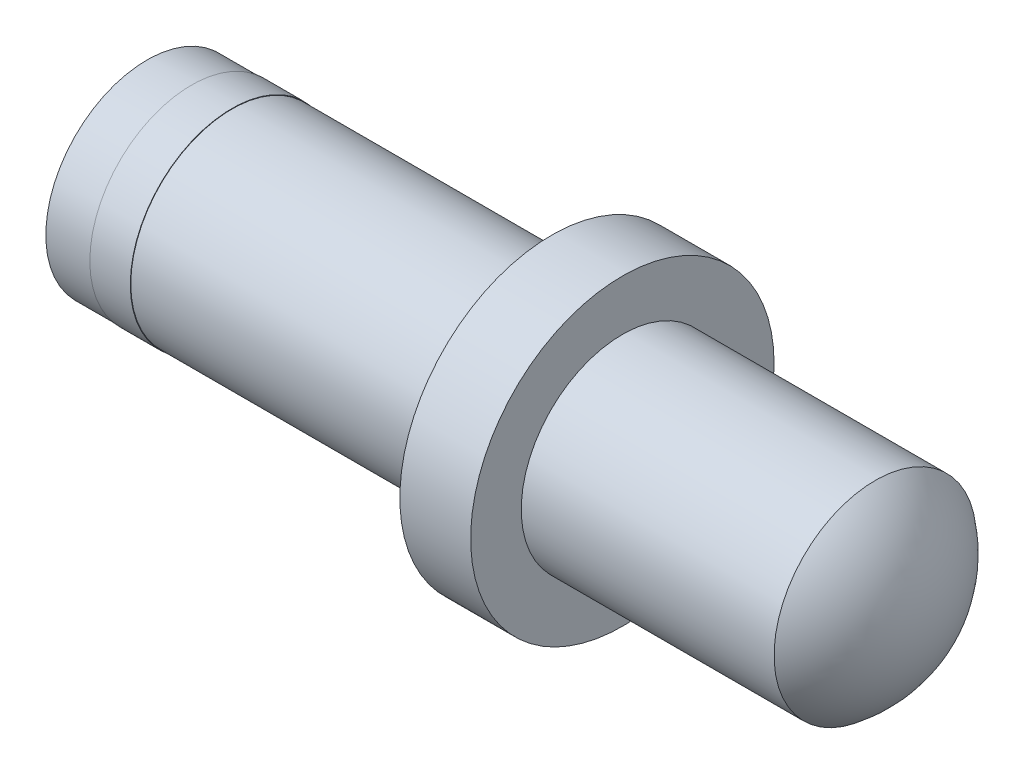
from build123d import *

# Parameters (mm, degrees)
D_ME1_FACE_RADIUS = 2
D_ME1_HEIGHT      = 1
ESQUISSE4_R       = 2.01
EXTRUSION3_DEPTH  = 0.8


with BuildPart() as part:
    # Esquisse1 → R_volution1 (revolve)
    with BuildSketch(Plane.XY, mode=Mode.PRIVATE) as r_volution1_sk:
        Polygon((0, 0), (0, 2), (8, 2), (8, 3), (9.4, 3), (9.4, 2), (14.4, 2), (14.4, 0), align=None)
    revolve(r_volution1_sk.sketch.rotate(Axis((14.4, 0, 0), (-1, 0, 0)), 90), axis=Axis((14.4, 0, 0), (-1, 0, 0)))

    # D_me1: a dome of height H over a round flat face of radius A is a cap of a sphere of radius (A * A + H * H) / (2 * H)
    d_me1_r = (D_ME1_FACE_RADIUS * D_ME1_FACE_RADIUS + D_ME1_HEIGHT * D_ME1_HEIGHT) / (2 * D_ME1_HEIGHT)
    d_me1_base = Plane((14.4, 0, 0), z_dir=(1, 0, 0))
    with Locations(d_me1_base.offset(D_ME1_HEIGHT - d_me1_r)):
        d_me1_ball = Sphere(d_me1_r, mode=Mode.PRIVATE)
    add(split(d_me1_ball, bisect_by=d_me1_base, keep=Keep.TOP, mode=Mode.PRIVATE))

    # Esquisse4 → Extrusion3 (add)
    with BuildSketch(Plane.ZY.offset(-1.68)):
        Circle(ESQUISSE4_R)
    extrude(amount=EXTRUSION3_DEPTH)


solid = part.part
